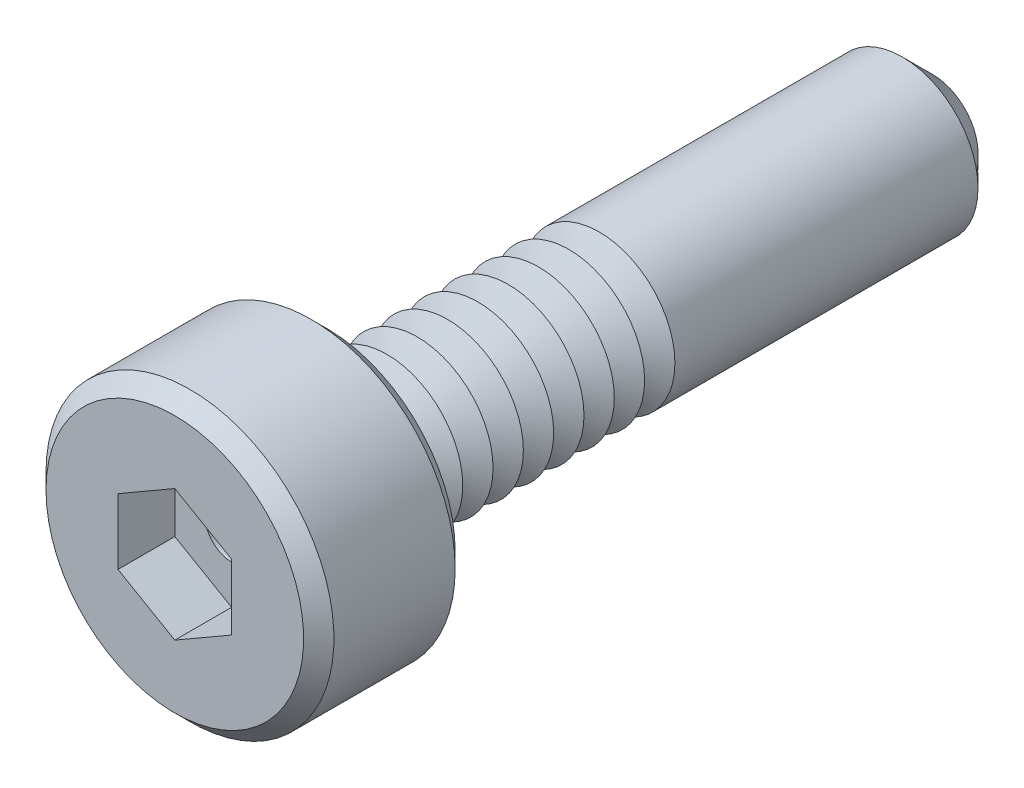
ISO-10303-21;
HEADER;
FILE_DESCRIPTION(('STEP AP214'),'2;1');
FILE_NAME('part.step','',(''),(''),'','','');
FILE_SCHEMA(('AUTOMOTIVE_DESIGN { 1 0 10303 214 1 1 1 1 }'));
ENDSEC;
DATA;
#1=APPLICATION_CONTEXT('core data for automotive mechanical design processes');
#2=APPLICATION_PROTOCOL_DEFINITION('international standard','automotive_design',2000,#1);
#3=PRODUCT_CONTEXT('',#1,'mechanical');
#4=PRODUCT('Part','Part','',(#3));
#5=PRODUCT_RELATED_PRODUCT_CATEGORY('part','',(#4));
#6=PRODUCT_DEFINITION_FORMATION('','',#4);
#7=PRODUCT_DEFINITION_CONTEXT('part definition',#1,'design');
#8=PRODUCT_DEFINITION('design','',#6,#7);
#9=PRODUCT_DEFINITION_SHAPE('','',#8);
#10=(LENGTH_UNIT() NAMED_UNIT(*) SI_UNIT(.MILLI.,.METRE.));
#11=(NAMED_UNIT(*) PLANE_ANGLE_UNIT() SI_UNIT($,.RADIAN.));
#12=(NAMED_UNIT(*) SI_UNIT($,.STERADIAN.) SOLID_ANGLE_UNIT());
#13=UNCERTAINTY_MEASURE_WITH_UNIT(LENGTH_MEASURE(1.E-05),#10,'distance_accuracy_value','');
#14=(GEOMETRIC_REPRESENTATION_CONTEXT(3) GLOBAL_UNCERTAINTY_ASSIGNED_CONTEXT((#13)) GLOBAL_UNIT_ASSIGNED_CONTEXT((#10,
#11,#12)) REPRESENTATION_CONTEXT('',''));
#15=CARTESIAN_POINT('',(0.,0.,0.));
#16=DIRECTION('',(0.,0.,1.));
#17=DIRECTION('',(1.,0.,0.));
#18=AXIS2_PLACEMENT_3D('',#15,#16,#17);
#19=CARTESIAN_POINT('',(0.,0.,2.));
#20=DIRECTION('',(0.,0.,-1.));
#21=DIRECTION('',(-1.,0.,0.));
#22=AXIS2_PLACEMENT_3D('',#19,#20,#21);
#23=CYLINDRICAL_SURFACE('',#22,1.9);
#24=CARTESIAN_POINT('',(0.,0.,0.200000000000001));
#25=DIRECTION('',(0.,0.,1.));
#26=DIRECTION('',(1.,0.,0.));
#27=AXIS2_PLACEMENT_3D('',#24,#25,#26);
#28=CIRCLE('',#27,1.9);
#29=CARTESIAN_POINT('',(1.9,0.,0.200000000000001));
#30=VERTEX_POINT('',#29);
#31=EDGE_CURVE('E253',#30,#30,#28,.T.);
#32=ORIENTED_EDGE('',*,*,#31,.T.);
#33=EDGE_LOOP('',(#32));
#34=FACE_BOUND('',#33,.T.);
#35=CARTESIAN_POINT('',(0.,0.,1.8));
#36=DIRECTION('',(0.,0.,1.));
#37=DIRECTION('',(1.,0.,0.));
#38=AXIS2_PLACEMENT_3D('',#35,#36,#37);
#39=CIRCLE('',#38,1.9);
#40=CARTESIAN_POINT('',(-1.9,0.,1.8));
#41=VERTEX_POINT('',#40);
#42=EDGE_CURVE('E249',#41,#41,#39,.F.);
#43=ORIENTED_EDGE('',*,*,#42,.T.);
#44=EDGE_LOOP('',(#43));
#45=FACE_BOUND('',#44,.T.);
#46=ADVANCED_FACE('F39',(#34,#45),#23,.T.);
#47=CARTESIAN_POINT('',(0.,0.,2.));
#48=DIRECTION('',(0.,0.,1.));
#49=DIRECTION('',(1.,0.,0.));
#50=AXIS2_PLACEMENT_3D('',#47,#48,#49);
#51=PLANE('',#50);
#52=CARTESIAN_POINT('',(0.,0.,2.));
#53=DIRECTION('',(0.,0.,1.));
#54=DIRECTION('',(1.,0.,0.));
#55=AXIS2_PLACEMENT_3D('',#52,#53,#54);
#56=CIRCLE('',#55,1.7);
#57=CARTESIAN_POINT('',(-1.7,0.,2.));
#58=VERTEX_POINT('',#57);
#59=EDGE_CURVE('E11',#58,#58,#56,.T.);
#60=ORIENTED_EDGE('',*,*,#59,.T.);
#61=EDGE_LOOP('',(#60));
#62=FACE_BOUND('',#61,.T.);
#63=DIRECTION('',(-0.866025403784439,0.5,0.));
#64=VECTOR('',#63,1.);
#65=CARTESIAN_POINT('',(0.749999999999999,0.433012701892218,2.));
#66=LINE('',#65,#64);
#67=CARTESIAN_POINT('',(0.749999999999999,0.433012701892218,2.));
#68=VERTEX_POINT('',#67);
#69=CARTESIAN_POINT('',(0.,0.866025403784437,2.));
#70=VERTEX_POINT('',#69);
#71=EDGE_CURVE('E55',#68,#70,#66,.T.);
#72=ORIENTED_EDGE('',*,*,#71,.F.);
#73=DIRECTION('',(0.,1.,0.));
#74=VECTOR('',#73,1.);
#75=CARTESIAN_POINT('',(0.75,-0.433012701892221,2.));
#76=LINE('',#75,#74);
#77=CARTESIAN_POINT('',(0.75,-0.433012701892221,2.));
#78=VERTEX_POINT('',#77);
#79=EDGE_CURVE('E151',#78,#68,#76,.T.);
#80=ORIENTED_EDGE('',*,*,#79,.F.);
#81=DIRECTION('',(0.866025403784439,0.5,0.));
#82=VECTOR('',#81,1.);
#83=CARTESIAN_POINT('',(0.,-0.86602540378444,2.));
#84=LINE('',#83,#82);
#85=CARTESIAN_POINT('',(0.,-0.86602540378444,2.));
#86=VERTEX_POINT('',#85);
#87=EDGE_CURVE('E148',#86,#78,#84,.T.);
#88=ORIENTED_EDGE('',*,*,#87,.F.);
#89=DIRECTION('',(0.866025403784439,-0.5,0.));
#90=VECTOR('',#89,1.);
#91=CARTESIAN_POINT('',(-0.75,-0.433012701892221,2.));
#92=LINE('',#91,#90);
#93=CARTESIAN_POINT('',(-0.75,-0.433012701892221,2.));
#94=VERTEX_POINT('',#93);
#95=EDGE_CURVE('E103',#94,#86,#92,.T.);
#96=ORIENTED_EDGE('',*,*,#95,.F.);
#97=DIRECTION('',(0.,-1.,0.));
#98=VECTOR('',#97,1.);
#99=CARTESIAN_POINT('',(-0.75,0.433012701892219,2.));
#100=LINE('',#99,#98);
#101=CARTESIAN_POINT('',(-0.75,0.433012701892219,2.));
#102=VERTEX_POINT('',#101);
#103=EDGE_CURVE('E142',#102,#94,#100,.T.);
#104=ORIENTED_EDGE('',*,*,#103,.F.);
#105=DIRECTION('',(-0.866025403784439,-0.499999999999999,0.));
#106=VECTOR('',#105,1.);
#107=CARTESIAN_POINT('',(0.,0.866025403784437,2.));
#108=LINE('',#107,#106);
#109=EDGE_CURVE('E137',#70,#102,#108,.T.);
#110=ORIENTED_EDGE('',*,*,#109,.F.);
#111=EDGE_LOOP('',(#72,#80,#88,#96,#104,#110));
#112=FACE_BOUND('',#111,.T.);
#113=ADVANCED_FACE('F271',(#62,#112),#51,.T.);
#114=CARTESIAN_POINT('',(0.,0.,0.));
#115=DIRECTION('',(0.,0.,1.));
#116=DIRECTION('',(1.,0.,0.));
#117=AXIS2_PLACEMENT_3D('',#114,#115,#116);
#118=PLANE('',#117);
#119=CARTESIAN_POINT('',(0.,0.,0.));
#120=DIRECTION('',(0.,0.,1.));
#121=DIRECTION('',(1.,0.,0.));
#122=AXIS2_PLACEMENT_3D('',#119,#120,#121);
#123=CIRCLE('',#122,1.7);
#124=CARTESIAN_POINT('',(1.7,0.,0.));
#125=VERTEX_POINT('',#124);
#126=EDGE_CURVE('E48',#125,#125,#123,.F.);
#127=ORIENTED_EDGE('',*,*,#126,.T.);
#128=EDGE_LOOP('',(#127));
#129=FACE_BOUND('',#128,.T.);
#130=CARTESIAN_POINT('',(0.,0.,0.));
#131=DIRECTION('',(0.,0.,1.));
#132=DIRECTION('',(1.,0.,0.));
#133=AXIS2_PLACEMENT_3D('',#130,#131,#132);
#134=CIRCLE('',#133,1.);
#135=CARTESIAN_POINT('',(1.,0.,0.));
#136=VERTEX_POINT('',#135);
#137=EDGE_CURVE('E237',#136,#136,#134,.T.);
#138=ORIENTED_EDGE('',*,*,#137,.T.);
#139=EDGE_LOOP('',(#138));
#140=FACE_BOUND('',#139,.T.);
#141=ADVANCED_FACE('F260',(#129,#140),#118,.F.);
#142=CARTESIAN_POINT('',(0.,0.,0.));
#143=DIRECTION('',(0.,0.,1.));
#144=DIRECTION('',(1.,0.,0.));
#145=AXIS2_PLACEMENT_3D('',#142,#143,#144);
#146=CONICAL_SURFACE('',#145,1.,1.0471975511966);
#147=CARTESIAN_POINT('',(0.,0.,-0.200000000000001));
#148=DIRECTION('',(0.,0.,1.));
#149=DIRECTION('',(1.,0.,0.));
#150=AXIS2_PLACEMENT_3D('',#147,#148,#149);
#151=CIRCLE('',#150,0.653589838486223);
#152=CARTESIAN_POINT('',(0.653589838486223,0.,-0.200000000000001));
#153=VERTEX_POINT('',#152);
#154=EDGE_CURVE('E233',#153,#153,#151,.T.);
#155=ORIENTED_EDGE('',*,*,#154,.T.);
#156=EDGE_LOOP('',(#155));
#157=FACE_BOUND('',#156,.T.);
#158=ORIENTED_EDGE('',*,*,#137,.F.);
#159=EDGE_LOOP('',(#158));
#160=FACE_BOUND('',#159,.T.);
#161=ADVANCED_FACE('F392',(#157,#160),#146,.T.);
#162=CARTESIAN_POINT('',(0.,0.,-0.200000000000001));
#163=DIRECTION('',(0.,0.,-1.));
#164=DIRECTION('',(-1.,0.,0.));
#165=AXIS2_PLACEMENT_3D('',#162,#163,#164);
#166=CONICAL_SURFACE('',#165,0.653589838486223,1.0471975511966);
#167=CARTESIAN_POINT('',(0.,0.,-0.4));
#168=DIRECTION('',(0.,0.,1.));
#169=DIRECTION('',(1.,0.,0.));
#170=AXIS2_PLACEMENT_3D('',#167,#168,#169);
#171=CIRCLE('',#170,1.);
#172=CARTESIAN_POINT('',(1.,0.,-0.4));
#173=VERTEX_POINT('',#172);
#174=EDGE_CURVE('E229',#173,#173,#171,.T.);
#175=ORIENTED_EDGE('',*,*,#174,.T.);
#176=EDGE_LOOP('',(#175));
#177=FACE_BOUND('',#176,.T.);
#178=ORIENTED_EDGE('',*,*,#154,.F.);
#179=EDGE_LOOP('',(#178));
#180=FACE_BOUND('',#179,.T.);
#181=ADVANCED_FACE('F388',(#177,#180),#166,.T.);
#182=CARTESIAN_POINT('',(0.,0.,-0.4));
#183=DIRECTION('',(0.,0.,1.));
#184=DIRECTION('',(1.,0.,0.));
#185=AXIS2_PLACEMENT_3D('',#182,#183,#184);
#186=CONICAL_SURFACE('',#185,1.,1.0471975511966);
#187=CARTESIAN_POINT('',(0.,0.,-0.600000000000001));
#188=DIRECTION('',(0.,0.,1.));
#189=DIRECTION('',(1.,0.,0.));
#190=AXIS2_PLACEMENT_3D('',#187,#188,#189);
#191=CIRCLE('',#190,0.653589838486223);
#192=CARTESIAN_POINT('',(0.653589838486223,0.,-0.600000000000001));
#193=VERTEX_POINT('',#192);
#194=EDGE_CURVE('E225',#193,#193,#191,.T.);
#195=ORIENTED_EDGE('',*,*,#194,.T.);
#196=EDGE_LOOP('',(#195));
#197=FACE_BOUND('',#196,.T.);
#198=ORIENTED_EDGE('',*,*,#174,.F.);
#199=EDGE_LOOP('',(#198));
#200=FACE_BOUND('',#199,.T.);
#201=ADVANCED_FACE('F384',(#197,#200),#186,.T.);
#202=CARTESIAN_POINT('',(0.,0.,-0.600000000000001));
#203=DIRECTION('',(0.,0.,-1.));
#204=DIRECTION('',(-1.,0.,0.));
#205=AXIS2_PLACEMENT_3D('',#202,#203,#204);
#206=CONICAL_SURFACE('',#205,0.653589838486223,1.0471975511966);
#207=CARTESIAN_POINT('',(0.,0.,-0.8));
#208=DIRECTION('',(0.,0.,1.));
#209=DIRECTION('',(1.,0.,0.));
#210=AXIS2_PLACEMENT_3D('',#207,#208,#209);
#211=CIRCLE('',#210,1.);
#212=CARTESIAN_POINT('',(1.,0.,-0.8));
#213=VERTEX_POINT('',#212);
#214=EDGE_CURVE('E221',#213,#213,#211,.T.);
#215=ORIENTED_EDGE('',*,*,#214,.T.);
#216=EDGE_LOOP('',(#215));
#217=FACE_BOUND('',#216,.T.);
#218=ORIENTED_EDGE('',*,*,#194,.F.);
#219=EDGE_LOOP('',(#218));
#220=FACE_BOUND('',#219,.T.);
#221=ADVANCED_FACE('F380',(#217,#220),#206,.T.);
#222=CARTESIAN_POINT('',(0.,0.,-0.8));
#223=DIRECTION('',(0.,0.,1.));
#224=DIRECTION('',(1.,0.,0.));
#225=AXIS2_PLACEMENT_3D('',#222,#223,#224);
#226=CONICAL_SURFACE('',#225,1.,1.0471975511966);
#227=CARTESIAN_POINT('',(0.,0.,-1.));
#228=DIRECTION('',(0.,0.,1.));
#229=DIRECTION('',(1.,0.,0.));
#230=AXIS2_PLACEMENT_3D('',#227,#228,#229);
#231=CIRCLE('',#230,0.653589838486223);
#232=CARTESIAN_POINT('',(0.653589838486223,0.,-1.));
#233=VERTEX_POINT('',#232);
#234=EDGE_CURVE('E217',#233,#233,#231,.T.);
#235=ORIENTED_EDGE('',*,*,#234,.T.);
#236=EDGE_LOOP('',(#235));
#237=FACE_BOUND('',#236,.T.);
#238=ORIENTED_EDGE('',*,*,#214,.F.);
#239=EDGE_LOOP('',(#238));
#240=FACE_BOUND('',#239,.T.);
#241=ADVANCED_FACE('F376',(#237,#240),#226,.T.);
#242=CARTESIAN_POINT('',(0.,0.,-1.));
#243=DIRECTION('',(0.,0.,-1.));
#244=DIRECTION('',(-1.,0.,0.));
#245=AXIS2_PLACEMENT_3D('',#242,#243,#244);
#246=CONICAL_SURFACE('',#245,0.653589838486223,1.0471975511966);
#247=CARTESIAN_POINT('',(0.,0.,-1.2));
#248=DIRECTION('',(0.,0.,1.));
#249=DIRECTION('',(1.,0.,0.));
#250=AXIS2_PLACEMENT_3D('',#247,#248,#249);
#251=CIRCLE('',#250,1.);
#252=CARTESIAN_POINT('',(1.,0.,-1.2));
#253=VERTEX_POINT('',#252);
#254=EDGE_CURVE('E213',#253,#253,#251,.T.);
#255=ORIENTED_EDGE('',*,*,#254,.T.);
#256=EDGE_LOOP('',(#255));
#257=FACE_BOUND('',#256,.T.);
#258=ORIENTED_EDGE('',*,*,#234,.F.);
#259=EDGE_LOOP('',(#258));
#260=FACE_BOUND('',#259,.T.);
#261=ADVANCED_FACE('F372',(#257,#260),#246,.T.);
#262=CARTESIAN_POINT('',(0.,0.,-1.2));
#263=DIRECTION('',(0.,0.,1.));
#264=DIRECTION('',(1.,0.,0.));
#265=AXIS2_PLACEMENT_3D('',#262,#263,#264);
#266=CONICAL_SURFACE('',#265,1.,1.0471975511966);
#267=CARTESIAN_POINT('',(0.,0.,-1.4));
#268=DIRECTION('',(0.,0.,1.));
#269=DIRECTION('',(1.,0.,0.));
#270=AXIS2_PLACEMENT_3D('',#267,#268,#269);
#271=CIRCLE('',#270,0.653589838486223);
#272=CARTESIAN_POINT('',(0.653589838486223,0.,-1.4));
#273=VERTEX_POINT('',#272);
#274=EDGE_CURVE('E209',#273,#273,#271,.T.);
#275=ORIENTED_EDGE('',*,*,#274,.T.);
#276=EDGE_LOOP('',(#275));
#277=FACE_BOUND('',#276,.T.);
#278=ORIENTED_EDGE('',*,*,#254,.F.);
#279=EDGE_LOOP('',(#278));
#280=FACE_BOUND('',#279,.T.);
#281=ADVANCED_FACE('F368',(#277,#280),#266,.T.);
#282=CARTESIAN_POINT('',(0.,0.,-1.4));
#283=DIRECTION('',(0.,0.,-1.));
#284=DIRECTION('',(-1.,0.,0.));
#285=AXIS2_PLACEMENT_3D('',#282,#283,#284);
#286=CONICAL_SURFACE('',#285,0.653589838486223,1.0471975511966);
#287=CARTESIAN_POINT('',(0.,0.,-1.6));
#288=DIRECTION('',(0.,0.,1.));
#289=DIRECTION('',(1.,0.,0.));
#290=AXIS2_PLACEMENT_3D('',#287,#288,#289);
#291=CIRCLE('',#290,1.);
#292=CARTESIAN_POINT('',(1.,0.,-1.6));
#293=VERTEX_POINT('',#292);
#294=EDGE_CURVE('E206',#293,#293,#291,.T.);
#295=ORIENTED_EDGE('',*,*,#294,.T.);
#296=EDGE_LOOP('',(#295));
#297=FACE_BOUND('',#296,.T.);
#298=ORIENTED_EDGE('',*,*,#274,.F.);
#299=EDGE_LOOP('',(#298));
#300=FACE_BOUND('',#299,.T.);
#301=ADVANCED_FACE('F364',(#297,#300),#286,.T.);
#302=CARTESIAN_POINT('',(0.,0.,-1.6));
#303=DIRECTION('',(0.,0.,1.));
#304=DIRECTION('',(1.,0.,0.));
#305=AXIS2_PLACEMENT_3D('',#302,#303,#304);
#306=CONICAL_SURFACE('',#305,1.,1.0471975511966);
#307=CARTESIAN_POINT('',(0.,0.,-1.8));
#308=DIRECTION('',(0.,0.,1.));
#309=DIRECTION('',(1.,0.,0.));
#310=AXIS2_PLACEMENT_3D('',#307,#308,#309);
#311=CIRCLE('',#310,0.653589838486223);
#312=CARTESIAN_POINT('',(0.653589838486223,0.,-1.8));
#313=VERTEX_POINT('',#312);
#314=EDGE_CURVE('E202',#313,#313,#311,.T.);
#315=ORIENTED_EDGE('',*,*,#314,.T.);
#316=EDGE_LOOP('',(#315));
#317=FACE_BOUND('',#316,.T.);
#318=ORIENTED_EDGE('',*,*,#294,.F.);
#319=EDGE_LOOP('',(#318));
#320=FACE_BOUND('',#319,.T.);
#321=ADVANCED_FACE('F360',(#317,#320),#306,.T.);
#322=CARTESIAN_POINT('',(0.,0.,-1.8));
#323=DIRECTION('',(0.,0.,-1.));
#324=DIRECTION('',(-1.,0.,0.));
#325=AXIS2_PLACEMENT_3D('',#322,#323,#324);
#326=CONICAL_SURFACE('',#325,0.653589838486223,1.0471975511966);
#327=CARTESIAN_POINT('',(0.,0.,-2.));
#328=DIRECTION('',(0.,0.,1.));
#329=DIRECTION('',(1.,0.,0.));
#330=AXIS2_PLACEMENT_3D('',#327,#328,#329);
#331=CIRCLE('',#330,1.);
#332=CARTESIAN_POINT('',(1.,0.,-2.));
#333=VERTEX_POINT('',#332);
#334=EDGE_CURVE('E198',#333,#333,#331,.T.);
#335=ORIENTED_EDGE('',*,*,#334,.T.);
#336=EDGE_LOOP('',(#335));
#337=FACE_BOUND('',#336,.T.);
#338=ORIENTED_EDGE('',*,*,#314,.F.);
#339=EDGE_LOOP('',(#338));
#340=FACE_BOUND('',#339,.T.);
#341=ADVANCED_FACE('F356',(#337,#340),#326,.T.);
#342=CARTESIAN_POINT('',(0.,0.,-2.));
#343=DIRECTION('',(0.,0.,1.));
#344=DIRECTION('',(1.,0.,0.));
#345=AXIS2_PLACEMENT_3D('',#342,#343,#344);
#346=CONICAL_SURFACE('',#345,1.,1.0471975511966);
#347=CARTESIAN_POINT('',(0.,0.,-2.2));
#348=DIRECTION('',(0.,0.,1.));
#349=DIRECTION('',(1.,0.,0.));
#350=AXIS2_PLACEMENT_3D('',#347,#348,#349);
#351=CIRCLE('',#350,0.653589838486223);
#352=CARTESIAN_POINT('',(0.653589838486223,0.,-2.2));
#353=VERTEX_POINT('',#352);
#354=EDGE_CURVE('E194',#353,#353,#351,.T.);
#355=ORIENTED_EDGE('',*,*,#354,.T.);
#356=EDGE_LOOP('',(#355));
#357=FACE_BOUND('',#356,.T.);
#358=ORIENTED_EDGE('',*,*,#334,.F.);
#359=EDGE_LOOP('',(#358));
#360=FACE_BOUND('',#359,.T.);
#361=ADVANCED_FACE('F352',(#357,#360),#346,.T.);
#362=CARTESIAN_POINT('',(0.,0.,-2.2));
#363=DIRECTION('',(0.,0.,-1.));
#364=DIRECTION('',(-1.,0.,0.));
#365=AXIS2_PLACEMENT_3D('',#362,#363,#364);
#366=CONICAL_SURFACE('',#365,0.653589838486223,1.0471975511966);
#367=CARTESIAN_POINT('',(0.,0.,-2.4));
#368=DIRECTION('',(0.,0.,1.));
#369=DIRECTION('',(1.,0.,0.));
#370=AXIS2_PLACEMENT_3D('',#367,#368,#369);
#371=CIRCLE('',#370,1.);
#372=CARTESIAN_POINT('',(1.,0.,-2.4));
#373=VERTEX_POINT('',#372);
#374=EDGE_CURVE('E190',#373,#373,#371,.T.);
#375=ORIENTED_EDGE('',*,*,#374,.T.);
#376=EDGE_LOOP('',(#375));
#377=FACE_BOUND('',#376,.T.);
#378=ORIENTED_EDGE('',*,*,#354,.F.);
#379=EDGE_LOOP('',(#378));
#380=FACE_BOUND('',#379,.T.);
#381=ADVANCED_FACE('F348',(#377,#380),#366,.T.);
#382=CARTESIAN_POINT('',(0.,0.,-2.4));
#383=DIRECTION('',(0.,0.,1.));
#384=DIRECTION('',(1.,0.,0.));
#385=AXIS2_PLACEMENT_3D('',#382,#383,#384);
#386=CONICAL_SURFACE('',#385,1.,1.0471975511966);
#387=CARTESIAN_POINT('',(0.,0.,-2.6));
#388=DIRECTION('',(0.,0.,1.));
#389=DIRECTION('',(1.,0.,0.));
#390=AXIS2_PLACEMENT_3D('',#387,#388,#389);
#391=CIRCLE('',#390,0.653589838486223);
#392=CARTESIAN_POINT('',(0.653589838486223,0.,-2.6));
#393=VERTEX_POINT('',#392);
#394=EDGE_CURVE('E186',#393,#393,#391,.T.);
#395=ORIENTED_EDGE('',*,*,#394,.T.);
#396=EDGE_LOOP('',(#395));
#397=FACE_BOUND('',#396,.T.);
#398=ORIENTED_EDGE('',*,*,#374,.F.);
#399=EDGE_LOOP('',(#398));
#400=FACE_BOUND('',#399,.T.);
#401=ADVANCED_FACE('F344',(#397,#400),#386,.T.);
#402=CARTESIAN_POINT('',(0.,0.,-2.6));
#403=DIRECTION('',(0.,0.,-1.));
#404=DIRECTION('',(-1.,0.,0.));
#405=AXIS2_PLACEMENT_3D('',#402,#403,#404);
#406=CONICAL_SURFACE('',#405,0.653589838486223,1.0471975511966);
#407=CARTESIAN_POINT('',(0.,0.,-2.8));
#408=DIRECTION('',(0.,0.,1.));
#409=DIRECTION('',(1.,0.,0.));
#410=AXIS2_PLACEMENT_3D('',#407,#408,#409);
#411=CIRCLE('',#410,1.);
#412=CARTESIAN_POINT('',(1.,0.,-2.8));
#413=VERTEX_POINT('',#412);
#414=EDGE_CURVE('E182',#413,#413,#411,.T.);
#415=ORIENTED_EDGE('',*,*,#414,.T.);
#416=EDGE_LOOP('',(#415));
#417=FACE_BOUND('',#416,.T.);
#418=ORIENTED_EDGE('',*,*,#394,.F.);
#419=EDGE_LOOP('',(#418));
#420=FACE_BOUND('',#419,.T.);
#421=ADVANCED_FACE('F340',(#417,#420),#406,.T.);
#422=CARTESIAN_POINT('',(0.,0.,-2.8));
#423=DIRECTION('',(0.,0.,1.));
#424=DIRECTION('',(1.,0.,0.));
#425=AXIS2_PLACEMENT_3D('',#422,#423,#424);
#426=CONICAL_SURFACE('',#425,1.,1.0471975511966);
#427=CARTESIAN_POINT('',(0.,0.,-3.));
#428=DIRECTION('',(0.,0.,1.));
#429=DIRECTION('',(1.,0.,0.));
#430=AXIS2_PLACEMENT_3D('',#427,#428,#429);
#431=CIRCLE('',#430,0.653589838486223);
#432=CARTESIAN_POINT('',(0.653589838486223,0.,-3.));
#433=VERTEX_POINT('',#432);
#434=EDGE_CURVE('E178',#433,#433,#431,.T.);
#435=ORIENTED_EDGE('',*,*,#434,.T.);
#436=EDGE_LOOP('',(#435));
#437=FACE_BOUND('',#436,.T.);
#438=ORIENTED_EDGE('',*,*,#414,.F.);
#439=EDGE_LOOP('',(#438));
#440=FACE_BOUND('',#439,.T.);
#441=ADVANCED_FACE('F336',(#437,#440),#426,.T.);
#442=CARTESIAN_POINT('',(0.,0.,-3.));
#443=DIRECTION('',(0.,0.,-1.));
#444=DIRECTION('',(-1.,0.,0.));
#445=AXIS2_PLACEMENT_3D('',#442,#443,#444);
#446=CONICAL_SURFACE('',#445,0.653589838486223,1.0471975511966);
#447=CARTESIAN_POINT('',(0.,0.,-3.2));
#448=DIRECTION('',(0.,0.,1.));
#449=DIRECTION('',(1.,0.,0.));
#450=AXIS2_PLACEMENT_3D('',#447,#448,#449);
#451=CIRCLE('',#450,1.);
#452=CARTESIAN_POINT('',(1.,0.,-3.2));
#453=VERTEX_POINT('',#452);
#454=EDGE_CURVE('E174',#453,#453,#451,.T.);
#455=ORIENTED_EDGE('',*,*,#454,.T.);
#456=EDGE_LOOP('',(#455));
#457=FACE_BOUND('',#456,.T.);
#458=ORIENTED_EDGE('',*,*,#434,.F.);
#459=EDGE_LOOP('',(#458));
#460=FACE_BOUND('',#459,.T.);
#461=ADVANCED_FACE('F332',(#457,#460),#446,.T.);
#462=CARTESIAN_POINT('',(0.,0.,-3.2));
#463=DIRECTION('',(0.,0.,1.));
#464=DIRECTION('',(1.,0.,0.));
#465=AXIS2_PLACEMENT_3D('',#462,#463,#464);
#466=CONICAL_SURFACE('',#465,1.,1.0471975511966);
#467=CARTESIAN_POINT('',(0.,0.,-3.4));
#468=DIRECTION('',(0.,0.,1.));
#469=DIRECTION('',(1.,0.,0.));
#470=AXIS2_PLACEMENT_3D('',#467,#468,#469);
#471=CIRCLE('',#470,0.653589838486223);
#472=CARTESIAN_POINT('',(0.653589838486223,0.,-3.4));
#473=VERTEX_POINT('',#472);
#474=EDGE_CURVE('E170',#473,#473,#471,.T.);
#475=ORIENTED_EDGE('',*,*,#474,.T.);
#476=EDGE_LOOP('',(#475));
#477=FACE_BOUND('',#476,.T.);
#478=ORIENTED_EDGE('',*,*,#454,.F.);
#479=EDGE_LOOP('',(#478));
#480=FACE_BOUND('',#479,.T.);
#481=ADVANCED_FACE('F328',(#477,#480),#466,.T.);
#482=CARTESIAN_POINT('',(0.,0.,-3.4));
#483=DIRECTION('',(0.,0.,-1.));
#484=DIRECTION('',(-1.,0.,0.));
#485=AXIS2_PLACEMENT_3D('',#482,#483,#484);
#486=CONICAL_SURFACE('',#485,0.653589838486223,1.0471975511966);
#487=CARTESIAN_POINT('',(0.,0.,-3.6));
#488=DIRECTION('',(0.,0.,1.));
#489=DIRECTION('',(1.,0.,0.));
#490=AXIS2_PLACEMENT_3D('',#487,#488,#489);
#491=CIRCLE('',#490,1.);
#492=CARTESIAN_POINT('',(1.,0.,-3.6));
#493=VERTEX_POINT('',#492);
#494=EDGE_CURVE('E157',#493,#493,#491,.T.);
#495=ORIENTED_EDGE('',*,*,#494,.T.);
#496=EDGE_LOOP('',(#495));
#497=FACE_BOUND('',#496,.T.);
#498=ORIENTED_EDGE('',*,*,#474,.F.);
#499=EDGE_LOOP('',(#498));
#500=FACE_BOUND('',#499,.T.);
#501=ADVANCED_FACE('F324',(#497,#500),#486,.T.);
#502=CARTESIAN_POINT('',(0.,0.,-8.));
#503=DIRECTION('',(0.,0.,-1.));
#504=DIRECTION('',(-1.,0.,0.));
#505=AXIS2_PLACEMENT_3D('',#502,#503,#504);
#506=PLANE('',#505);
#507=CARTESIAN_POINT('',(0.,0.,-8.));
#508=DIRECTION('',(0.,0.,-1.));
#509=DIRECTION('',(-1.,0.,0.));
#510=AXIS2_PLACEMENT_3D('',#507,#508,#509);
#511=CIRCLE('',#510,0.35);
#512=CARTESIAN_POINT('',(-0.35,0.,-8.));
#513=VERTEX_POINT('',#512);
#514=EDGE_CURVE('E138',#513,#513,#511,.F.);
#515=ORIENTED_EDGE('',*,*,#514,.T.);
#516=EDGE_LOOP('',(#515));
#517=FACE_BOUND('',#516,.T.);
#518=CARTESIAN_POINT('',(0.,0.,-8.));
#519=DIRECTION('',(0.,0.,-1.));
#520=DIRECTION('',(-1.,0.,0.));
#521=AXIS2_PLACEMENT_3D('',#518,#519,#520);
#522=CIRCLE('',#521,0.600000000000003);
#523=CARTESIAN_POINT('',(-0.600000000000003,0.,-8.));
#524=VERTEX_POINT('',#523);
#525=EDGE_CURVE('E241',#524,#524,#522,.T.);
#526=ORIENTED_EDGE('',*,*,#525,.T.);
#527=EDGE_LOOP('',(#526));
#528=FACE_BOUND('',#527,.T.);
#529=ADVANCED_FACE('F327',(#517,#528),#506,.T.);
#530=CARTESIAN_POINT('',(0.,0.,-8.));
#531=DIRECTION('',(0.,0.,1.));
#532=DIRECTION('',(1.,0.,0.));
#533=AXIS2_PLACEMENT_3D('',#530,#531,#532);
#534=CONICAL_SURFACE('',#533,0.600000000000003,0.785398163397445);
#535=CARTESIAN_POINT('',(0.,0.,-7.6));
#536=DIRECTION('',(0.,0.,-1.));
#537=DIRECTION('',(-1.,0.,0.));
#538=AXIS2_PLACEMENT_3D('',#535,#536,#537);
#539=CIRCLE('',#538,1.);
#540=CARTESIAN_POINT('',(-1.,0.,-7.6));
#541=VERTEX_POINT('',#540);
#542=EDGE_CURVE('E245',#541,#541,#539,.F.);
#543=ORIENTED_EDGE('',*,*,#542,.F.);
#544=EDGE_LOOP('',(#543));
#545=FACE_BOUND('',#544,.T.);
#546=ORIENTED_EDGE('',*,*,#525,.F.);
#547=EDGE_LOOP('',(#546));
#548=FACE_BOUND('',#547,.T.);
#549=ADVANCED_FACE('F399',(#545,#548),#534,.T.);
#550=CARTESIAN_POINT('',(0.,0.,-8.));
#551=DIRECTION('',(0.,0.,1.));
#552=DIRECTION('',(1.,0.,0.));
#553=AXIS2_PLACEMENT_3D('',#550,#551,#552);
#554=CYLINDRICAL_SURFACE('',#553,1.);
#555=ORIENTED_EDGE('',*,*,#542,.T.);
#556=EDGE_LOOP('',(#555));
#557=FACE_BOUND('',#556,.T.);
#558=ORIENTED_EDGE('',*,*,#494,.F.);
#559=EDGE_LOOP('',(#558));
#560=FACE_BOUND('',#559,.T.);
#561=ADVANCED_FACE('F323',(#557,#560),#554,.T.);
#562=CARTESIAN_POINT('',(0.749999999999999,0.433012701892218,1.25));
#563=DIRECTION('',(0.5,0.866025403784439,0.));
#564=DIRECTION('',(-0.866025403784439,0.5,0.));
#565=AXIS2_PLACEMENT_3D('',#562,#563,#564);
#566=PLANE('',#565);
#567=ORIENTED_EDGE('',*,*,#71,.T.);
#568=DIRECTION('',(0.,0.,1.));
#569=VECTOR('',#568,1.);
#570=CARTESIAN_POINT('',(0.,0.866025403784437,1.25));
#571=LINE('',#570,#569);
#572=CARTESIAN_POINT('',(0.,0.866025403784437,1.25));
#573=VERTEX_POINT('',#572);
#574=EDGE_CURVE('E85',#573,#70,#571,.T.);
#575=ORIENTED_EDGE('',*,*,#574,.F.);
#576=DIRECTION('',(-0.866025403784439,0.5,0.));
#577=VECTOR('',#576,1.);
#578=CARTESIAN_POINT('',(0.749999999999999,0.433012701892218,1.25));
#579=LINE('',#578,#577);
#580=CARTESIAN_POINT('',(0.749999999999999,0.433012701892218,1.25));
#581=VERTEX_POINT('',#580);
#582=EDGE_CURVE('E154',#581,#573,#579,.T.);
#583=ORIENTED_EDGE('',*,*,#582,.F.);
#584=DIRECTION('',(0.,0.,1.));
#585=VECTOR('',#584,1.);
#586=CARTESIAN_POINT('',(0.749999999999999,0.433012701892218,1.25));
#587=LINE('',#586,#585);
#588=EDGE_CURVE('E63',#581,#68,#587,.T.);
#589=ORIENTED_EDGE('',*,*,#588,.T.);
#590=EDGE_LOOP('',(#567,#575,#583,#589));
#591=FACE_BOUND('',#590,.T.);
#592=ADVANCED_FACE('F313',(#591),#566,.F.);
#593=CARTESIAN_POINT('',(0.75,-0.433012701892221,1.25));
#594=DIRECTION('',(1.,0.,0.));
#595=DIRECTION('',(0.,1.,0.));
#596=AXIS2_PLACEMENT_3D('',#593,#594,#595);
#597=PLANE('',#596);
#598=ORIENTED_EDGE('',*,*,#79,.T.);
#599=ORIENTED_EDGE('',*,*,#588,.F.);
#600=DIRECTION('',(0.,1.,0.));
#601=VECTOR('',#600,1.);
#602=CARTESIAN_POINT('',(0.75,-0.433012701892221,1.25));
#603=LINE('',#602,#601);
#604=CARTESIAN_POINT('',(0.75,-0.433012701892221,1.25));
#605=VERTEX_POINT('',#604);
#606=EDGE_CURVE('E117',#605,#581,#603,.T.);
#607=ORIENTED_EDGE('',*,*,#606,.F.);
#608=DIRECTION('',(0.,0.,1.));
#609=VECTOR('',#608,1.);
#610=CARTESIAN_POINT('',(0.75,-0.433012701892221,1.25));
#611=LINE('',#610,#609);
#612=EDGE_CURVE('E108',#605,#78,#611,.T.);
#613=ORIENTED_EDGE('',*,*,#612,.T.);
#614=EDGE_LOOP('',(#598,#599,#607,#613));
#615=FACE_BOUND('',#614,.T.);
#616=ADVANCED_FACE('F310',(#615),#597,.F.);
#617=CARTESIAN_POINT('',(0.,-0.86602540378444,1.25));
#618=DIRECTION('',(0.5,-0.866025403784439,0.));
#619=DIRECTION('',(0.866025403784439,0.5,0.));
#620=AXIS2_PLACEMENT_3D('',#617,#618,#619);
#621=PLANE('',#620);
#622=ORIENTED_EDGE('',*,*,#87,.T.);
#623=ORIENTED_EDGE('',*,*,#612,.F.);
#624=DIRECTION('',(0.866025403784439,0.5,0.));
#625=VECTOR('',#624,1.);
#626=CARTESIAN_POINT('',(0.,-0.86602540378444,1.25));
#627=LINE('',#626,#625);
#628=CARTESIAN_POINT('',(0.,-0.86602540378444,1.25));
#629=VERTEX_POINT('',#628);
#630=EDGE_CURVE('E112',#629,#605,#627,.T.);
#631=ORIENTED_EDGE('',*,*,#630,.F.);
#632=DIRECTION('',(0.,0.,1.));
#633=VECTOR('',#632,1.);
#634=CARTESIAN_POINT('',(0.,-0.86602540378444,1.25));
#635=LINE('',#634,#633);
#636=EDGE_CURVE('E96',#629,#86,#635,.T.);
#637=ORIENTED_EDGE('',*,*,#636,.T.);
#638=EDGE_LOOP('',(#622,#623,#631,#637));
#639=FACE_BOUND('',#638,.T.);
#640=ADVANCED_FACE('F113',(#639),#621,.F.);
#641=CARTESIAN_POINT('',(-0.75,-0.433012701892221,1.25));
#642=DIRECTION('',(-0.5,-0.866025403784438,0.));
#643=DIRECTION('',(0.866025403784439,-0.5,0.));
#644=AXIS2_PLACEMENT_3D('',#641,#642,#643);
#645=PLANE('',#644);
#646=ORIENTED_EDGE('',*,*,#95,.T.);
#647=ORIENTED_EDGE('',*,*,#636,.F.);
#648=DIRECTION('',(0.866025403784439,-0.5,0.));
#649=VECTOR('',#648,1.);
#650=CARTESIAN_POINT('',(-0.75,-0.433012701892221,1.25));
#651=LINE('',#650,#649);
#652=CARTESIAN_POINT('',(-0.75,-0.433012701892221,1.25));
#653=VERTEX_POINT('',#652);
#654=EDGE_CURVE('E100',#653,#629,#651,.T.);
#655=ORIENTED_EDGE('',*,*,#654,.F.);
#656=DIRECTION('',(0.,0.,1.));
#657=VECTOR('',#656,1.);
#658=CARTESIAN_POINT('',(-0.75,-0.433012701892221,1.25));
#659=LINE('',#658,#657);
#660=EDGE_CURVE('E109',#653,#94,#659,.T.);
#661=ORIENTED_EDGE('',*,*,#660,.T.);
#662=EDGE_LOOP('',(#646,#647,#655,#661));
#663=FACE_BOUND('',#662,.T.);
#664=ADVANCED_FACE('F98',(#663),#645,.F.);
#665=CARTESIAN_POINT('',(-0.75,0.433012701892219,1.25));
#666=DIRECTION('',(-1.,0.,0.));
#667=DIRECTION('',(0.,0.,1.));
#668=AXIS2_PLACEMENT_3D('',#665,#666,#667);
#669=PLANE('',#668);
#670=ORIENTED_EDGE('',*,*,#103,.T.);
#671=ORIENTED_EDGE('',*,*,#660,.F.);
#672=DIRECTION('',(0.,-1.,0.));
#673=VECTOR('',#672,1.);
#674=CARTESIAN_POINT('',(-0.75,0.433012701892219,1.25));
#675=LINE('',#674,#673);
#676=CARTESIAN_POINT('',(-0.75,0.433012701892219,1.25));
#677=VERTEX_POINT('',#676);
#678=EDGE_CURVE('E123',#677,#653,#675,.T.);
#679=ORIENTED_EDGE('',*,*,#678,.F.);
#680=DIRECTION('',(0.,0.,1.));
#681=VECTOR('',#680,1.);
#682=CARTESIAN_POINT('',(-0.75,0.433012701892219,1.25));
#683=LINE('',#682,#681);
#684=EDGE_CURVE('E162',#677,#102,#683,.T.);
#685=ORIENTED_EDGE('',*,*,#684,.T.);
#686=EDGE_LOOP('',(#670,#671,#679,#685));
#687=FACE_BOUND('',#686,.T.);
#688=ADVANCED_FACE('F307',(#687),#669,.F.);
#689=CARTESIAN_POINT('',(0.,0.866025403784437,1.25));
#690=DIRECTION('',(-0.499999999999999,0.866025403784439,0.));
#691=DIRECTION('',(-0.866025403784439,-0.499999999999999,0.));
#692=AXIS2_PLACEMENT_3D('',#689,#690,#691);
#693=PLANE('',#692);
#694=ORIENTED_EDGE('',*,*,#109,.T.);
#695=ORIENTED_EDGE('',*,*,#684,.F.);
#696=DIRECTION('',(-0.866025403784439,-0.499999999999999,0.));
#697=VECTOR('',#696,1.);
#698=CARTESIAN_POINT('',(0.,0.866025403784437,1.25));
#699=LINE('',#698,#697);
#700=EDGE_CURVE('E129',#573,#677,#699,.T.);
#701=ORIENTED_EDGE('',*,*,#700,.F.);
#702=ORIENTED_EDGE('',*,*,#574,.T.);
#703=EDGE_LOOP('',(#694,#695,#701,#702));
#704=FACE_BOUND('',#703,.T.);
#705=ADVANCED_FACE('F286',(#704),#693,.F.);
#706=CARTESIAN_POINT('',(0.,0.,1.25));
#707=DIRECTION('',(0.,0.,1.));
#708=DIRECTION('',(1.,0.,0.));
#709=AXIS2_PLACEMENT_3D('',#706,#707,#708);
#710=PLANE('',#709);
#711=CARTESIAN_POINT('',(0.,0.,1.25));
#712=DIRECTION('',(0.,0.,1.));
#713=DIRECTION('',(1.,0.,0.));
#714=AXIS2_PLACEMENT_3D('',#711,#712,#713);
#715=CIRCLE('',#714,0.35);
#716=CARTESIAN_POINT('',(0.35,0.,1.25));
#717=VERTEX_POINT('',#716);
#718=EDGE_CURVE('E293',#717,#717,#715,.T.);
#719=ORIENTED_EDGE('',*,*,#718,.F.);
#720=EDGE_LOOP('',(#719));
#721=FACE_BOUND('',#720,.T.);
#722=ORIENTED_EDGE('',*,*,#582,.T.);
#723=ORIENTED_EDGE('',*,*,#700,.T.);
#724=ORIENTED_EDGE('',*,*,#678,.T.);
#725=ORIENTED_EDGE('',*,*,#654,.T.);
#726=ORIENTED_EDGE('',*,*,#630,.T.);
#727=ORIENTED_EDGE('',*,*,#606,.T.);
#728=EDGE_LOOP('',(#722,#723,#724,#725,#726,#727));
#729=FACE_BOUND('',#728,.T.);
#730=ADVANCED_FACE('F120',(#721,#729),#710,.T.);
#731=CARTESIAN_POINT('',(0.,0.,-8.98994949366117));
#732=DIRECTION('',(0.,0.,1.));
#733=DIRECTION('',(1.,0.,0.));
#734=AXIS2_PLACEMENT_3D('',#731,#732,#733);
#735=CYLINDRICAL_SURFACE('',#734,0.35);
#736=ORIENTED_EDGE('',*,*,#718,.T.);
#737=EDGE_LOOP('',(#736));
#738=FACE_BOUND('',#737,.T.);
#739=ORIENTED_EDGE('',*,*,#514,.F.);
#740=EDGE_LOOP('',(#739));
#741=FACE_BOUND('',#740,.T.);
#742=ADVANCED_FACE('F266',(#738,#741),#735,.F.);
#743=CARTESIAN_POINT('',(0.,0.,0.200000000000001));
#744=DIRECTION('',(0.,0.,1.));
#745=DIRECTION('',(1.,0.,0.));
#746=AXIS2_PLACEMENT_3D('',#743,#744,#745);
#747=CONICAL_SURFACE('',#746,1.9,0.78539816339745);
#748=ORIENTED_EDGE('',*,*,#126,.F.);
#749=EDGE_LOOP('',(#748));
#750=FACE_BOUND('',#749,.T.);
#751=ORIENTED_EDGE('',*,*,#31,.F.);
#752=EDGE_LOOP('',(#751));
#753=FACE_BOUND('',#752,.T.);
#754=ADVANCED_FACE('F263',(#750,#753),#747,.T.);
#755=CARTESIAN_POINT('',(0.,0.,2.));
#756=DIRECTION('',(0.,0.,-1.));
#757=DIRECTION('',(-1.,0.,0.));
#758=AXIS2_PLACEMENT_3D('',#755,#756,#757);
#759=CONICAL_SURFACE('',#758,1.7,0.785398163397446);
#760=CARTESIAN_POINT('',(-1.9,0.,1.8));
#761=CARTESIAN_POINT('',(-1.89791666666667,0.,1.80208333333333));
#762=CARTESIAN_POINT('',(-1.89583333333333,0.,1.80416666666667));
#763=CARTESIAN_POINT('',(-1.89166666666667,0.,1.80833333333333));
#764=CARTESIAN_POINT('',(-1.88958333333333,0.,1.81041666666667));
#765=CARTESIAN_POINT('',(-1.88541666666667,0.,1.81458333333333));
#766=CARTESIAN_POINT('',(-1.88333333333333,0.,1.81666666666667));
#767=CARTESIAN_POINT('',(-1.87916666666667,0.,1.82083333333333));
#768=CARTESIAN_POINT('',(-1.87708333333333,0.,1.82291666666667));
#769=CARTESIAN_POINT('',(-1.87291666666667,0.,1.82708333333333));
#770=CARTESIAN_POINT('',(-1.87083333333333,0.,1.82916666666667));
#771=CARTESIAN_POINT('',(-1.86666666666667,0.,1.83333333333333));
#772=CARTESIAN_POINT('',(-1.86458333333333,0.,1.83541666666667));
#773=CARTESIAN_POINT('',(-1.86041666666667,0.,1.83958333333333));
#774=CARTESIAN_POINT('',(-1.85833333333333,0.,1.84166666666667));
#775=CARTESIAN_POINT('',(-1.85416666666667,0.,1.84583333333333));
#776=CARTESIAN_POINT('',(-1.85208333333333,0.,1.84791666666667));
#777=CARTESIAN_POINT('',(-1.84791666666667,0.,1.85208333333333));
#778=CARTESIAN_POINT('',(-1.84583333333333,0.,1.85416666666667));
#779=CARTESIAN_POINT('',(-1.84166666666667,0.,1.85833333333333));
#780=CARTESIAN_POINT('',(-1.83958333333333,0.,1.86041666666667));
#781=CARTESIAN_POINT('',(-1.83541666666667,0.,1.86458333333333));
#782=CARTESIAN_POINT('',(-1.83333333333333,0.,1.86666666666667));
#783=CARTESIAN_POINT('',(-1.82916666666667,0.,1.87083333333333));
#784=CARTESIAN_POINT('',(-1.82708333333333,0.,1.87291666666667));
#785=CARTESIAN_POINT('',(-1.82291666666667,0.,1.87708333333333));
#786=CARTESIAN_POINT('',(-1.82083333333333,0.,1.87916666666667));
#787=CARTESIAN_POINT('',(-1.81666666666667,0.,1.88333333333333));
#788=CARTESIAN_POINT('',(-1.81458333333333,0.,1.88541666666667));
#789=CARTESIAN_POINT('',(-1.81041666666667,0.,1.88958333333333));
#790=CARTESIAN_POINT('',(-1.80833333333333,0.,1.89166666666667));
#791=CARTESIAN_POINT('',(-1.80416666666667,0.,1.89583333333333));
#792=CARTESIAN_POINT('',(-1.80208333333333,0.,1.89791666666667));
#793=CARTESIAN_POINT('',(-1.79791666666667,0.,1.90208333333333));
#794=CARTESIAN_POINT('',(-1.79583333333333,0.,1.90416666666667));
#795=CARTESIAN_POINT('',(-1.79166666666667,0.,1.90833333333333));
#796=CARTESIAN_POINT('',(-1.78958333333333,0.,1.91041666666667));
#797=CARTESIAN_POINT('',(-1.78541666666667,0.,1.91458333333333));
#798=CARTESIAN_POINT('',(-1.78333333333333,0.,1.91666666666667));
#799=CARTESIAN_POINT('',(-1.77916666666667,0.,1.92083333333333));
#800=CARTESIAN_POINT('',(-1.77708333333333,0.,1.92291666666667));
#801=CARTESIAN_POINT('',(-1.77291666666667,0.,1.92708333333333));
#802=CARTESIAN_POINT('',(-1.77083333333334,0.,1.92916666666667));
#803=CARTESIAN_POINT('',(-1.76666666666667,0.,1.93333333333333));
#804=CARTESIAN_POINT('',(-1.76458333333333,0.,1.93541666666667));
#805=CARTESIAN_POINT('',(-1.76041666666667,0.,1.93958333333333));
#806=CARTESIAN_POINT('',(-1.75833333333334,0.,1.94166666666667));
#807=CARTESIAN_POINT('',(-1.75416666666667,0.,1.94583333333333));
#808=CARTESIAN_POINT('',(-1.75208333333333,0.,1.94791666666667));
#809=CARTESIAN_POINT('',(-1.74791666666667,0.,1.95208333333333));
#810=CARTESIAN_POINT('',(-1.74583333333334,0.,1.95416666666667));
#811=CARTESIAN_POINT('',(-1.74166666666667,0.,1.95833333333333));
#812=CARTESIAN_POINT('',(-1.73958333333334,0.,1.96041666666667));
#813=CARTESIAN_POINT('',(-1.73541666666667,0.,1.96458333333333));
#814=CARTESIAN_POINT('',(-1.73333333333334,0.,1.96666666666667));
#815=CARTESIAN_POINT('',(-1.72916666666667,0.,1.97083333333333));
#816=CARTESIAN_POINT('',(-1.72708333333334,0.,1.97291666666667));
#817=CARTESIAN_POINT('',(-1.72291666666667,0.,1.97708333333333));
#818=CARTESIAN_POINT('',(-1.72083333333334,0.,1.97916666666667));
#819=CARTESIAN_POINT('',(-1.71666666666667,0.,1.98333333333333));
#820=CARTESIAN_POINT('',(-1.71458333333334,0.,1.98541666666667));
#821=CARTESIAN_POINT('',(-1.71041666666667,0.,1.98958333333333));
#822=CARTESIAN_POINT('',(-1.70833333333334,0.,1.99166666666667));
#823=CARTESIAN_POINT('',(-1.70416666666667,0.,1.99583333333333));
#824=CARTESIAN_POINT('',(-1.70208333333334,0.,1.99791666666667));
#825=CARTESIAN_POINT('',(-1.7,0.,2.));
#826=B_SPLINE_CURVE_WITH_KNOTS('',3,(#760,#761,#762,#763,#764,#765,#766,#767,#768,#769,#770,
#771,#772,#773,#774,#775,#776,#777,#778,#779,#780,#781,#782,#783,#784,#785,#786,#787,#788,#789,
#790,#791,#792,#793,#794,#795,#796,#797,#798,#799,#800,#801,#802,#803,#804,#805,#806,#807,#808,
#809,#810,#811,#812,#813,#814,#815,#816,#817,#818,#819,#820,#821,#822,#823,#824,#825),
.UNSPECIFIED.,.F.,.F.,(4,2,2,2,2,2,2,2,2,2,2,2,2,2,2,2,2,2,2,2,2,2,2,2,2,2,2,2,2,2,2,2,4),(0.,
0.00883883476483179,0.0176776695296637,0.0265165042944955,0.0353553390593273,0.0441941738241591,
0.0530330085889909,0.0618718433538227,0.0707106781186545,0.0795495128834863,0.0883883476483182,
0.09722718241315,0.106066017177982,0.114904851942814,0.123743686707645,0.132582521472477,
0.141421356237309,0.150260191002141,0.159099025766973,0.167937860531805,0.176776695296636,
0.185615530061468,0.1944543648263,0.203293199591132,0.212132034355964,0.220970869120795,
0.229809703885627,0.238648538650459,0.247487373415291,0.256326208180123,0.265165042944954,
0.274003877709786,0.282842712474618),.UNSPECIFIED.);
#827=EDGE_CURVE('BSEAM41',#41,#58,#826,.T.);
#828=ORIENTED_EDGE('',*,*,#42,.F.);
#829=ORIENTED_EDGE('',*,*,#59,.F.);
#830=ORIENTED_EDGE('',*,*,#827,.T.);
#831=ORIENTED_EDGE('',*,*,#827,.F.);
#832=EDGE_LOOP('',(#828,#830,#829,#831));
#833=FACE_BOUND('',#832,.T.);
#834=ADVANCED_FACE('F41',(#833),#759,.T.);
#835=CLOSED_SHELL('',(#46,#113,#141,#161,#181,#201,#221,#241,#261,#281,#301,#321,#341,#361,#381,
#401,#421,#441,#461,#481,#501,#529,#549,#561,#592,#616,#640,#664,#688,#705,#730,#742,#754,#834));
#836=MANIFOLD_SOLID_BREP('B2',#835);
#837=ADVANCED_BREP_SHAPE_REPRESENTATION('',(#18,#836),#14);
#838=SHAPE_DEFINITION_REPRESENTATION(#9,#837);
ENDSEC;
END-ISO-10303-21;
